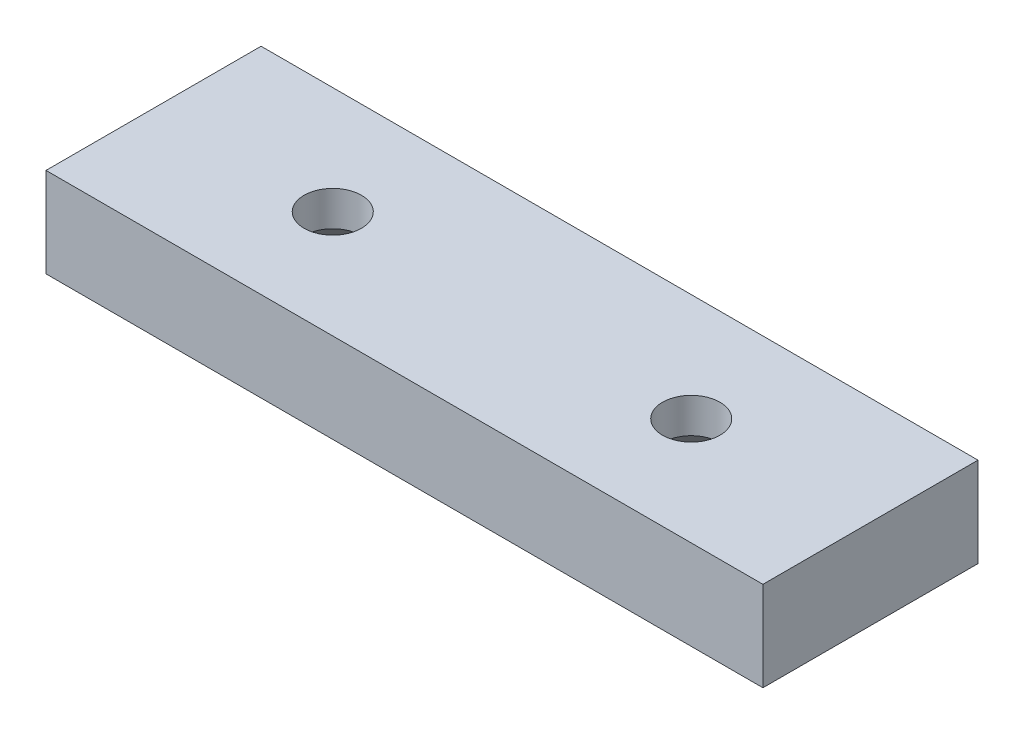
from build123d import *

# Parameters (mm, degrees)
ESQUISSE1_W                              = 80
ESQUISSE1_H                              = 24
BASE_DEPTH                               = 10
FRAISAGE_POUR_VIS_T_TE_FRAIS_E_F_2_COUNT = 2
FRAISAGE_POUR_VIS_T_TE_FRAIS_E_F_2_PITCH = 40


with BuildPart() as part:
    # Esquisse1 → BASE (new body)
    with BuildSketch(Plane(origin=(0, 0, 0), x_dir=(1, 0, 0), z_dir=(0, 1, 0))):
        with Locations((40, 0)):
            Rectangle(ESQUISSE1_W, ESQUISSE1_H)
    extrude(amount=BASE_DEPTH)

    # Esquisse2 → Fraisage pour vis _ t_te frais_e _ fond (revolve, cut)
    with BuildSketch(Plane(origin=(20, 0, 0), x_dir=(0, 0, -1), z_dir=(1, 0, 0))):
        Polygon((0, 0), (0, 10), (3.2, 10), (3.2, 6.1), (6.3, 3), (6.3, 0), align=None)
    fraisage_pour_vis_t_te_frais_e_fond = revolve(axis=Axis((20, -6.35, 0), (0, 1, 0)), mode=Mode.SUBTRACT)

    # Fraisage pour vis _ t_te frais_e _ f 2: Fraisage pour vis _ t_te frais_e _ fond ×2
    with Locations(*[(i * FRAISAGE_POUR_VIS_T_TE_FRAIS_E_F_2_PITCH, 0, 0) for i in range(1, FRAISAGE_POUR_VIS_T_TE_FRAIS_E_F_2_COUNT)]):
        add(fraisage_pour_vis_t_te_frais_e_fond, mode=Mode.SUBTRACT)


solid = part.part
